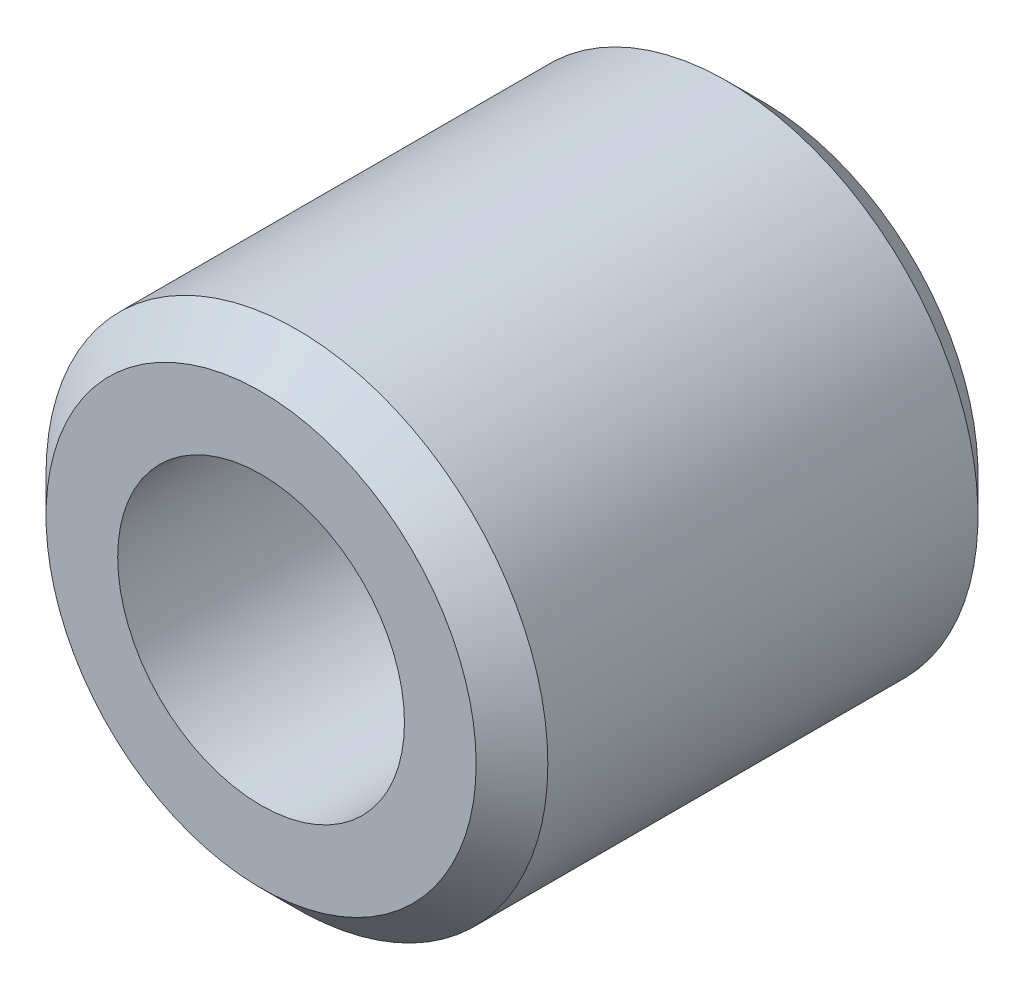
ISO-10303-21;
HEADER;
FILE_DESCRIPTION(('STEP AP214'),'2;1');
FILE_NAME('part.step','',(''),(''),'','','');
FILE_SCHEMA(('AUTOMOTIVE_DESIGN { 1 0 10303 214 1 1 1 1 }'));
ENDSEC;
DATA;
#1=APPLICATION_CONTEXT('core data for automotive mechanical design processes');
#2=APPLICATION_PROTOCOL_DEFINITION('international standard','automotive_design',2000,#1);
#3=PRODUCT_CONTEXT('',#1,'mechanical');
#4=PRODUCT('Part','Part','',(#3));
#5=PRODUCT_RELATED_PRODUCT_CATEGORY('part','',(#4));
#6=PRODUCT_DEFINITION_FORMATION('','',#4);
#7=PRODUCT_DEFINITION_CONTEXT('part definition',#1,'design');
#8=PRODUCT_DEFINITION('design','',#6,#7);
#9=PRODUCT_DEFINITION_SHAPE('','',#8);
#10=(LENGTH_UNIT() NAMED_UNIT(*) SI_UNIT(.MILLI.,.METRE.));
#11=(NAMED_UNIT(*) PLANE_ANGLE_UNIT() SI_UNIT($,.RADIAN.));
#12=(NAMED_UNIT(*) SI_UNIT($,.STERADIAN.) SOLID_ANGLE_UNIT());
#13=UNCERTAINTY_MEASURE_WITH_UNIT(LENGTH_MEASURE(1.E-05),#10,'distance_accuracy_value','');
#14=(GEOMETRIC_REPRESENTATION_CONTEXT(3) GLOBAL_UNCERTAINTY_ASSIGNED_CONTEXT((#13)) GLOBAL_UNIT_ASSIGNED_CONTEXT((#10,
#11,#12)) REPRESENTATION_CONTEXT('',''));
#15=CARTESIAN_POINT('',(0.,0.,0.));
#16=DIRECTION('',(0.,0.,1.));
#17=DIRECTION('',(1.,0.,0.));
#18=AXIS2_PLACEMENT_3D('',#15,#16,#17);
#19=CARTESIAN_POINT('',(0.,0.,0.));
#20=DIRECTION('',(0.,0.,-1.));
#21=DIRECTION('',(-1.,0.,0.));
#22=AXIS2_PLACEMENT_3D('',#19,#20,#21);
#23=CYLINDRICAL_SURFACE('',#22,4.);
#24=CARTESIAN_POINT('',(0.,0.,0.));
#25=DIRECTION('',(0.,0.,-1.));
#26=DIRECTION('',(-1.,0.,0.));
#27=AXIS2_PLACEMENT_3D('',#24,#25,#26);
#28=CIRCLE('',#27,4.);
#29=CARTESIAN_POINT('',(-4.,0.,0.));
#30=VERTEX_POINT('',#29);
#31=EDGE_CURVE('E34',#30,#30,#28,.T.);
#32=ORIENTED_EDGE('',*,*,#31,.T.);
#33=EDGE_LOOP('',(#32));
#34=FACE_BOUND('',#33,.T.);
#35=CARTESIAN_POINT('',(0.,0.,14.));
#36=DIRECTION('',(0.,0.,-1.));
#37=DIRECTION('',(-1.,0.,0.));
#38=AXIS2_PLACEMENT_3D('',#35,#36,#37);
#39=CIRCLE('',#38,4.);
#40=CARTESIAN_POINT('',(-4.,0.,14.));
#41=VERTEX_POINT('',#40);
#42=EDGE_CURVE('E31',#41,#41,#39,.T.);
#43=ORIENTED_EDGE('',*,*,#42,.F.);
#44=EDGE_LOOP('',(#43));
#45=FACE_BOUND('',#44,.T.);
#46=ADVANCED_FACE('F12',(#34,#45),#23,.F.);
#47=CARTESIAN_POINT('',(-4.,0.,14.));
#48=DIRECTION('',(0.,0.,1.));
#49=DIRECTION('',(1.,0.,0.));
#50=AXIS2_PLACEMENT_3D('',#47,#48,#49);
#51=PLANE('',#50);
#52=CARTESIAN_POINT('',(0.,0.,14.));
#53=DIRECTION('',(0.,0.,1.));
#54=DIRECTION('',(1.,0.,0.));
#55=AXIS2_PLACEMENT_3D('',#52,#53,#54);
#56=CIRCLE('',#55,6.);
#57=CARTESIAN_POINT('',(6.,0.,14.));
#58=VERTEX_POINT('',#57);
#59=EDGE_CURVE('E8',#58,#58,#56,.T.);
#60=ORIENTED_EDGE('',*,*,#59,.T.);
#61=EDGE_LOOP('',(#60));
#62=FACE_BOUND('',#61,.T.);
#63=ORIENTED_EDGE('',*,*,#42,.T.);
#64=EDGE_LOOP('',(#63));
#65=FACE_BOUND('',#64,.T.);
#66=ADVANCED_FACE('F55',(#62,#65),#51,.T.);
#67=CARTESIAN_POINT('',(0.,0.,0.));
#68=DIRECTION('',(0.,0.,-1.));
#69=DIRECTION('',(-1.,0.,0.));
#70=AXIS2_PLACEMENT_3D('',#67,#68,#69);
#71=CYLINDRICAL_SURFACE('',#70,7.);
#72=CARTESIAN_POINT('',(0.,0.,0.999999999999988));
#73=DIRECTION('',(0.,0.,-1.));
#74=DIRECTION('',(-1.,0.,0.));
#75=AXIS2_PLACEMENT_3D('',#72,#73,#74);
#76=CIRCLE('',#75,7.);
#77=CARTESIAN_POINT('',(-7.,0.,0.999999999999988));
#78=VERTEX_POINT('',#77);
#79=EDGE_CURVE('E18',#78,#78,#76,.F.);
#80=ORIENTED_EDGE('',*,*,#79,.T.);
#81=EDGE_LOOP('',(#80));
#82=FACE_BOUND('',#81,.T.);
#83=CARTESIAN_POINT('',(0.,0.,13.));
#84=DIRECTION('',(0.,0.,1.));
#85=DIRECTION('',(1.,0.,0.));
#86=AXIS2_PLACEMENT_3D('',#83,#84,#85);
#87=CIRCLE('',#86,7.);
#88=CARTESIAN_POINT('',(7.,0.,13.));
#89=VERTEX_POINT('',#88);
#90=EDGE_CURVE('E22',#89,#89,#87,.F.);
#91=ORIENTED_EDGE('',*,*,#90,.T.);
#92=EDGE_LOOP('',(#91));
#93=FACE_BOUND('',#92,.T.);
#94=ADVANCED_FACE('F43',(#82,#93),#71,.T.);
#95=CARTESIAN_POINT('',(-4.,0.,0.));
#96=DIRECTION('',(0.,0.,-1.));
#97=DIRECTION('',(-1.,0.,0.));
#98=AXIS2_PLACEMENT_3D('',#95,#96,#97);
#99=PLANE('',#98);
#100=CARTESIAN_POINT('',(0.,0.,0.));
#101=DIRECTION('',(0.,0.,-1.));
#102=DIRECTION('',(-1.,0.,0.));
#103=AXIS2_PLACEMENT_3D('',#100,#101,#102);
#104=CIRCLE('',#103,6.);
#105=CARTESIAN_POINT('',(-6.,0.,0.));
#106=VERTEX_POINT('',#105);
#107=EDGE_CURVE('E26',#106,#106,#104,.T.);
#108=ORIENTED_EDGE('',*,*,#107,.T.);
#109=EDGE_LOOP('',(#108));
#110=FACE_BOUND('',#109,.T.);
#111=ORIENTED_EDGE('',*,*,#31,.F.);
#112=EDGE_LOOP('',(#111));
#113=FACE_BOUND('',#112,.T.);
#114=ADVANCED_FACE('F40',(#110,#113),#99,.T.);
#115=CARTESIAN_POINT('',(0.,0.,0.));
#116=DIRECTION('',(0.,0.,1.));
#117=DIRECTION('',(1.,0.,0.));
#118=AXIS2_PLACEMENT_3D('',#115,#116,#117);
#119=CONICAL_SURFACE('',#118,6.,0.785398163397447);
#120=ORIENTED_EDGE('',*,*,#79,.F.);
#121=EDGE_LOOP('',(#120));
#122=FACE_BOUND('',#121,.T.);
#123=ORIENTED_EDGE('',*,*,#107,.F.);
#124=EDGE_LOOP('',(#123));
#125=FACE_BOUND('',#124,.T.);
#126=ADVANCED_FACE('F42',(#122,#125),#119,.T.);
#127=CARTESIAN_POINT('',(0.,0.,13.));
#128=DIRECTION('',(0.,0.,-1.));
#129=DIRECTION('',(-1.,0.,0.));
#130=AXIS2_PLACEMENT_3D('',#127,#128,#129);
#131=CONICAL_SURFACE('',#130,7.,0.78539816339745);
#132=ORIENTED_EDGE('',*,*,#59,.F.);
#133=EDGE_LOOP('',(#132));
#134=FACE_BOUND('',#133,.T.);
#135=ORIENTED_EDGE('',*,*,#90,.F.);
#136=EDGE_LOOP('',(#135));
#137=FACE_BOUND('',#136,.T.);
#138=ADVANCED_FACE('F52',(#134,#137),#131,.T.);
#139=CLOSED_SHELL('',(#46,#66,#94,#114,#126,#138));
#140=MANIFOLD_SOLID_BREP('B1',#139);
#141=ADVANCED_BREP_SHAPE_REPRESENTATION('',(#18,#140),#14);
#142=SHAPE_DEFINITION_REPRESENTATION(#9,#141);
ENDSEC;
END-ISO-10303-21;
